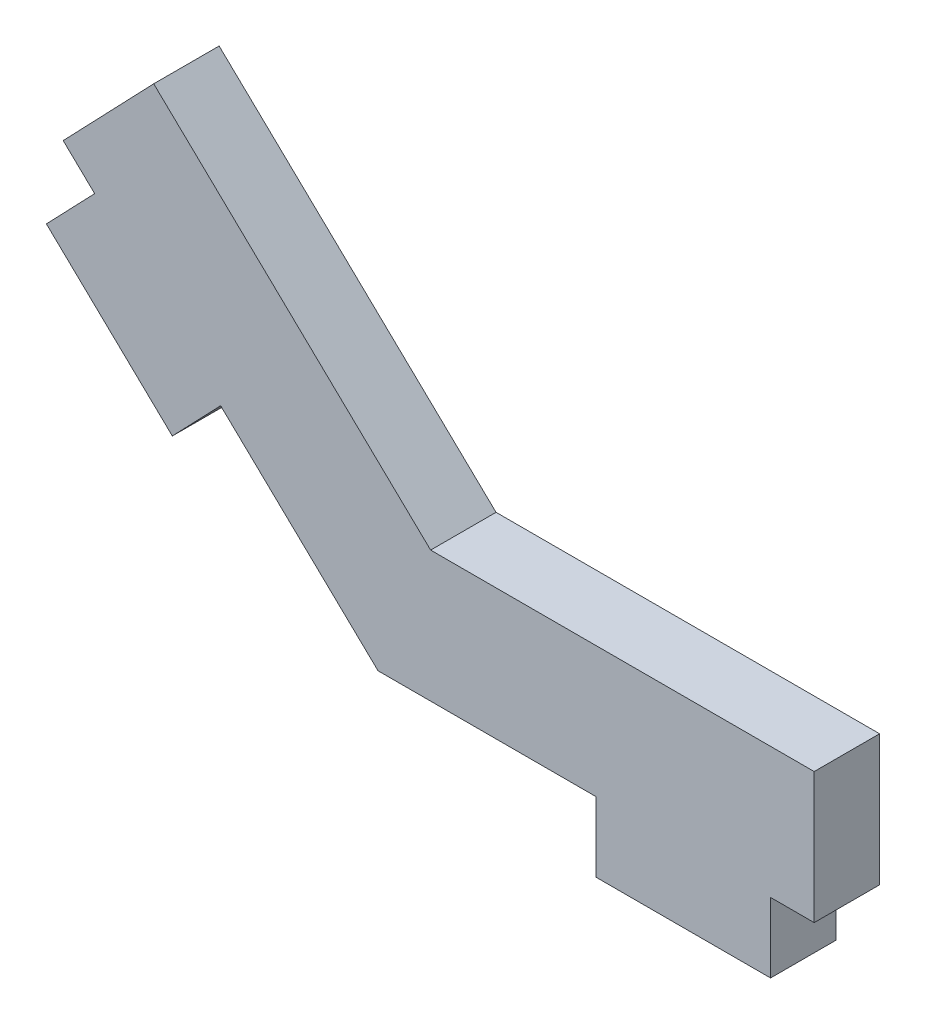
ISO-10303-21;
HEADER;
FILE_DESCRIPTION(('STEP AP214'),'2;1');
FILE_NAME('part.step','',(''),(''),'','','');
FILE_SCHEMA(('AUTOMOTIVE_DESIGN { 1 0 10303 214 1 1 1 1 }'));
ENDSEC;
DATA;
#1=APPLICATION_CONTEXT('core data for automotive mechanical design processes');
#2=APPLICATION_PROTOCOL_DEFINITION('international standard','automotive_design',2000,#1);
#3=PRODUCT_CONTEXT('',#1,'mechanical');
#4=PRODUCT('Part','Part','',(#3));
#5=PRODUCT_RELATED_PRODUCT_CATEGORY('part','',(#4));
#6=PRODUCT_DEFINITION_FORMATION('','',#4);
#7=PRODUCT_DEFINITION_CONTEXT('part definition',#1,'design');
#8=PRODUCT_DEFINITION('design','',#6,#7);
#9=PRODUCT_DEFINITION_SHAPE('','',#8);
#10=(LENGTH_UNIT() NAMED_UNIT(*) SI_UNIT(.MILLI.,.METRE.));
#11=(NAMED_UNIT(*) PLANE_ANGLE_UNIT() SI_UNIT($,.RADIAN.));
#12=(NAMED_UNIT(*) SI_UNIT($,.STERADIAN.) SOLID_ANGLE_UNIT());
#13=UNCERTAINTY_MEASURE_WITH_UNIT(LENGTH_MEASURE(1.E-05),#10,'distance_accuracy_value','');
#14=(GEOMETRIC_REPRESENTATION_CONTEXT(3) GLOBAL_UNCERTAINTY_ASSIGNED_CONTEXT((#13)) GLOBAL_UNIT_ASSIGNED_CONTEXT((#10,
#11,#12)) REPRESENTATION_CONTEXT('',''));
#15=CARTESIAN_POINT('',(0.,0.,0.));
#16=DIRECTION('',(0.,0.,1.));
#17=DIRECTION('',(1.,0.,0.));
#18=AXIS2_PLACEMENT_3D('',#15,#16,#17);
#19=CARTESIAN_POINT('',(0.,0.,3.));
#20=DIRECTION('',(0.,1.,0.));
#21=DIRECTION('',(0.,0.,1.));
#22=AXIS2_PLACEMENT_3D('',#19,#20,#21);
#23=PLANE('',#22);
#24=DIRECTION('',(0.,0.,-1.));
#25=VECTOR('',#24,1.);
#26=CARTESIAN_POINT('',(10.,0.,3.));
#27=LINE('',#26,#25);
#28=CARTESIAN_POINT('',(10.,0.,3.));
#29=VERTEX_POINT('',#28);
#30=CARTESIAN_POINT('',(10.,0.,0.));
#31=VERTEX_POINT('',#30);
#32=EDGE_CURVE('E140',#29,#31,#27,.T.);
#33=ORIENTED_EDGE('',*,*,#32,.F.);
#34=DIRECTION('',(1.,0.,0.));
#35=VECTOR('',#34,1.);
#36=CARTESIAN_POINT('',(0.,0.,3.));
#37=LINE('',#36,#35);
#38=CARTESIAN_POINT('',(0.,0.,3.));
#39=VERTEX_POINT('',#38);
#40=EDGE_CURVE('E157',#39,#29,#37,.T.);
#41=ORIENTED_EDGE('',*,*,#40,.F.);
#42=DIRECTION('',(0.,0.,-1.));
#43=VECTOR('',#42,1.);
#44=CARTESIAN_POINT('',(0.,0.,3.));
#45=LINE('',#44,#43);
#46=CARTESIAN_POINT('',(0.,0.,0.));
#47=VERTEX_POINT('',#46);
#48=EDGE_CURVE('E189',#39,#47,#45,.T.);
#49=ORIENTED_EDGE('',*,*,#48,.T.);
#50=DIRECTION('',(1.,0.,0.));
#51=VECTOR('',#50,1.);
#52=CARTESIAN_POINT('',(0.,0.,0.));
#53=LINE('',#52,#51);
#54=EDGE_CURVE('E184',#47,#31,#53,.T.);
#55=ORIENTED_EDGE('',*,*,#54,.T.);
#56=EDGE_LOOP('',(#33,#41,#49,#55));
#57=FACE_BOUND('',#56,.T.);
#58=ADVANCED_FACE('F35',(#57),#23,.F.);
#59=CARTESIAN_POINT('',(0.,0.,3.));
#60=DIRECTION('',(-0.691891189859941,-0.722001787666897,0.));
#61=DIRECTION('',(0.722001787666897,-0.691891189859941,0.));
#62=AXIS2_PLACEMENT_3D('',#59,#60,#61);
#63=PLANE('',#62);
#64=DIRECTION('',(-0.722001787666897,0.691891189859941,0.));
#65=VECTOR('',#64,1.);
#66=CARTESIAN_POINT('',(0.,0.,0.));
#67=LINE('',#66,#65);
#68=CARTESIAN_POINT('',(-12.9960321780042,12.4540414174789,0.));
#69=VERTEX_POINT('',#68);
#70=CARTESIAN_POINT('',(-14.4400357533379,13.8378237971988,0.));
#71=VERTEX_POINT('',#70);
#72=EDGE_CURVE('E179',#69,#71,#67,.T.);
#73=ORIENTED_EDGE('',*,*,#72,.F.);
#74=DIRECTION('',(0.,0.,-1.));
#75=VECTOR('',#74,1.);
#76=CARTESIAN_POINT('',(-12.9960321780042,12.4540414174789,3.));
#77=LINE('',#76,#75);
#78=CARTESIAN_POINT('',(-12.9960321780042,12.4540414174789,3.));
#79=VERTEX_POINT('',#78);
#80=EDGE_CURVE('E229',#79,#69,#77,.T.);
#81=ORIENTED_EDGE('',*,*,#80,.F.);
#82=DIRECTION('',(-0.722001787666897,0.691891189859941,0.));
#83=VECTOR('',#82,1.);
#84=CARTESIAN_POINT('',(0.,0.,3.));
#85=LINE('',#84,#83);
#86=CARTESIAN_POINT('',(-14.4400357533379,13.8378237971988,3.));
#87=VERTEX_POINT('',#86);
#88=EDGE_CURVE('E162',#79,#87,#85,.T.);
#89=ORIENTED_EDGE('',*,*,#88,.T.);
#90=DIRECTION('',(0.,0.,-1.));
#91=VECTOR('',#90,1.);
#92=CARTESIAN_POINT('',(-14.4400357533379,13.8378237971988,3.));
#93=LINE('',#92,#91);
#94=EDGE_CURVE('E191',#87,#71,#93,.T.);
#95=ORIENTED_EDGE('',*,*,#94,.T.);
#96=EDGE_LOOP('',(#73,#81,#89,#95));
#97=FACE_BOUND('',#96,.T.);
#98=ADVANCED_FACE('F270',(#97),#63,.T.);
#99=CARTESIAN_POINT('',(20.,0.,3.));
#100=DIRECTION('',(1.,0.,0.));
#101=DIRECTION('',(0.,0.,-1.));
#102=AXIS2_PLACEMENT_3D('',#99,#100,#101);
#103=PLANE('',#102);
#104=DIRECTION('',(0.,-1.,0.));
#105=VECTOR('',#104,1.);
#106=CARTESIAN_POINT('',(20.,0.,0.));
#107=LINE('',#106,#105);
#108=CARTESIAN_POINT('',(20.,6.,0.));
#109=VERTEX_POINT('',#108);
#110=CARTESIAN_POINT('',(20.,0.,0.));
#111=VERTEX_POINT('',#110);
#112=EDGE_CURVE('E166',#109,#111,#107,.T.);
#113=ORIENTED_EDGE('',*,*,#112,.F.);
#114=DIRECTION('',(0.,0.,-1.));
#115=VECTOR('',#114,1.);
#116=CARTESIAN_POINT('',(20.,6.,3.));
#117=LINE('',#116,#115);
#118=CARTESIAN_POINT('',(20.,6.,3.));
#119=VERTEX_POINT('',#118);
#120=EDGE_CURVE('E11',#119,#109,#117,.T.);
#121=ORIENTED_EDGE('',*,*,#120,.F.);
#122=DIRECTION('',(0.,-1.,0.));
#123=VECTOR('',#122,1.);
#124=CARTESIAN_POINT('',(20.,0.,3.));
#125=LINE('',#124,#123);
#126=CARTESIAN_POINT('',(20.,0.,3.));
#127=VERTEX_POINT('',#126);
#128=EDGE_CURVE('E187',#119,#127,#125,.T.);
#129=ORIENTED_EDGE('',*,*,#128,.T.);
#130=DIRECTION('',(0.,0.,-1.));
#131=VECTOR('',#130,1.);
#132=CARTESIAN_POINT('',(20.,0.,3.));
#133=LINE('',#132,#131);
#134=EDGE_CURVE('E155',#127,#111,#133,.T.);
#135=ORIENTED_EDGE('',*,*,#134,.T.);
#136=EDGE_LOOP('',(#113,#121,#129,#135));
#137=FACE_BOUND('',#136,.T.);
#138=ADVANCED_FACE('F37',(#137),#103,.T.);
#139=CARTESIAN_POINT('',(0.,6.,3.));
#140=DIRECTION('',(0.,1.,0.));
#141=DIRECTION('',(-1.,0.,0.));
#142=AXIS2_PLACEMENT_3D('',#139,#140,#141);
#143=PLANE('',#142);
#144=DIRECTION('',(1.,0.,0.));
#145=VECTOR('',#144,1.);
#146=CARTESIAN_POINT('',(0.,6.,0.));
#147=LINE('',#146,#145);
#148=CARTESIAN_POINT('',(2.41076819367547,5.99999999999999,0.));
#149=VERTEX_POINT('',#148);
#150=EDGE_CURVE('E169',#149,#109,#147,.T.);
#151=ORIENTED_EDGE('',*,*,#150,.F.);
#152=DIRECTION('',(0.,0.,-1.));
#153=VECTOR('',#152,1.);
#154=CARTESIAN_POINT('',(2.41076819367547,5.99999999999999,3.));
#155=LINE('',#154,#153);
#156=CARTESIAN_POINT('',(2.41076819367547,5.99999999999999,3.));
#157=VERTEX_POINT('',#156);
#158=EDGE_CURVE('E43',#157,#149,#155,.T.);
#159=ORIENTED_EDGE('',*,*,#158,.F.);
#160=DIRECTION('',(1.,0.,0.));
#161=VECTOR('',#160,1.);
#162=CARTESIAN_POINT('',(0.,6.,3.));
#163=LINE('',#162,#161);
#164=EDGE_CURVE('E217',#157,#119,#163,.T.);
#165=ORIENTED_EDGE('',*,*,#164,.T.);
#166=ORIENTED_EDGE('',*,*,#120,.T.);
#167=EDGE_LOOP('',(#151,#159,#165,#166));
#168=FACE_BOUND('',#167,.T.);
#169=ADVANCED_FACE('F205',(#168),#143,.T.);
#170=CARTESIAN_POINT('',(4.15134713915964,4.33201072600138,3.));
#171=DIRECTION('',(0.691891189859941,0.722001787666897,0.));
#172=DIRECTION('',(-0.722001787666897,0.691891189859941,0.));
#173=AXIS2_PLACEMENT_3D('',#170,#171,#172);
#174=PLANE('',#173);
#175=DIRECTION('',(0.722001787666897,-0.691891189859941,0.));
#176=VECTOR('',#175,1.);
#177=CARTESIAN_POINT('',(4.15134713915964,4.33201072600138,0.));
#178=LINE('',#177,#176);
#179=CARTESIAN_POINT('',(-10.2886886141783,18.1698345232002,0.));
#180=VERTEX_POINT('',#179);
#181=EDGE_CURVE('E173',#180,#149,#178,.T.);
#182=ORIENTED_EDGE('',*,*,#181,.F.);
#183=DIRECTION('',(0.,0.,-1.));
#184=VECTOR('',#183,1.);
#185=CARTESIAN_POINT('',(-10.2886886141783,18.1698345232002,3.));
#186=LINE('',#185,#184);
#187=CARTESIAN_POINT('',(-10.2886886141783,18.1698345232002,3.));
#188=VERTEX_POINT('',#187);
#189=EDGE_CURVE('E194',#188,#180,#186,.T.);
#190=ORIENTED_EDGE('',*,*,#189,.F.);
#191=DIRECTION('',(0.722001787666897,-0.691891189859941,0.));
#192=VECTOR('',#191,1.);
#193=CARTESIAN_POINT('',(4.15134713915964,4.33201072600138,3.));
#194=LINE('',#193,#192);
#195=EDGE_CURVE('E201',#188,#157,#194,.T.);
#196=ORIENTED_EDGE('',*,*,#195,.T.);
#197=ORIENTED_EDGE('',*,*,#158,.T.);
#198=EDGE_LOOP('',(#182,#190,#196,#197));
#199=FACE_BOUND('',#198,.T.);
#200=ADVANCED_FACE('F199',(#199),#174,.T.);
#201=CARTESIAN_POINT('',(-14.440035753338,13.8378237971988,3.));
#202=DIRECTION('',(-0.722001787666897,0.691891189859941,0.));
#203=DIRECTION('',(-0.691891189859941,-0.722001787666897,0.));
#204=AXIS2_PLACEMENT_3D('',#201,#202,#203);
#205=PLANE('',#204);
#206=DIRECTION('',(0.691891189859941,0.722001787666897,0.));
#207=VECTOR('',#206,1.);
#208=CARTESIAN_POINT('',(-14.440035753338,13.8378237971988,0.));
#209=LINE('',#208,#207);
#210=EDGE_CURVE('E176',#71,#180,#209,.T.);
#211=ORIENTED_EDGE('',*,*,#210,.F.);
#212=ORIENTED_EDGE('',*,*,#94,.F.);
#213=DIRECTION('',(0.691891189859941,0.722001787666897,0.));
#214=VECTOR('',#213,1.);
#215=CARTESIAN_POINT('',(-14.440035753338,13.8378237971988,3.));
#216=LINE('',#215,#214);
#217=EDGE_CURVE('E215',#87,#188,#216,.T.);
#218=ORIENTED_EDGE('',*,*,#217,.T.);
#219=ORIENTED_EDGE('',*,*,#189,.T.);
#220=EDGE_LOOP('',(#211,#212,#218,#219));
#221=FACE_BOUND('',#220,.T.);
#222=ADVANCED_FACE('F212',(#221),#205,.T.);
#223=DIRECTION('',(0.,0.,-1.));
#224=VECTOR('',#223,1.);
#225=CARTESIAN_POINT('',(-7.22001787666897,6.91891189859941,3.));
#226=LINE('',#225,#224);
#227=CARTESIAN_POINT('',(-7.22001787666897,6.91891189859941,3.));
#228=VERTEX_POINT('',#227);
#229=CARTESIAN_POINT('',(-7.22001787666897,6.91891189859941,0.));
#230=VERTEX_POINT('',#229);
#231=EDGE_CURVE('E226',#228,#230,#226,.T.);
#232=ORIENTED_EDGE('',*,*,#231,.T.);
#233=EDGE_CURVE('E180',#47,#230,#67,.T.);
#234=ORIENTED_EDGE('',*,*,#233,.F.);
#235=ORIENTED_EDGE('',*,*,#48,.F.);
#236=EDGE_CURVE('E158',#39,#228,#85,.T.);
#237=ORIENTED_EDGE('',*,*,#236,.T.);
#238=EDGE_LOOP('',(#232,#234,#235,#237));
#239=FACE_BOUND('',#238,.T.);
#240=ADVANCED_FACE('F277',(#239),#63,.T.);
#241=CARTESIAN_POINT('',(18.,0.,3.));
#242=VERTEX_POINT('',#241);
#243=EDGE_CURVE('E145',#242,#127,#37,.T.);
#244=ORIENTED_EDGE('',*,*,#243,.F.);
#245=DIRECTION('',(0.,0.,-1.));
#246=VECTOR('',#245,1.);
#247=CARTESIAN_POINT('',(18.,0.,3.));
#248=LINE('',#247,#246);
#249=CARTESIAN_POINT('',(18.,0.,0.));
#250=VERTEX_POINT('',#249);
#251=EDGE_CURVE('E133',#242,#250,#248,.T.);
#252=ORIENTED_EDGE('',*,*,#251,.T.);
#253=EDGE_CURVE('E183',#250,#111,#53,.T.);
#254=ORIENTED_EDGE('',*,*,#253,.T.);
#255=ORIENTED_EDGE('',*,*,#134,.F.);
#256=EDGE_LOOP('',(#244,#252,#254,#255));
#257=FACE_BOUND('',#256,.T.);
#258=ADVANCED_FACE('F153',(#257),#23,.F.);
#259=CARTESIAN_POINT('',(0.,0.,3.));
#260=DIRECTION('',(0.,0.,1.));
#261=DIRECTION('',(1.,0.,0.));
#262=AXIS2_PLACEMENT_3D('',#259,#260,#261);
#263=PLANE('',#262);
#264=ORIENTED_EDGE('',*,*,#128,.F.);
#265=ORIENTED_EDGE('',*,*,#164,.F.);
#266=ORIENTED_EDGE('',*,*,#195,.F.);
#267=ORIENTED_EDGE('',*,*,#217,.F.);
#268=ORIENTED_EDGE('',*,*,#88,.F.);
#269=DIRECTION('',(-0.691891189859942,-0.722001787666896,0.));
#270=VECTOR('',#269,1.);
#271=CARTESIAN_POINT('',(-12.9960321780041,12.4540414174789,3.));
#272=LINE('',#271,#270);
#273=CARTESIAN_POINT('',(-15.210083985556,10.1436356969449,3.));
#274=VERTEX_POINT('',#273);
#275=EDGE_CURVE('E235',#79,#274,#272,.T.);
#276=ORIENTED_EDGE('',*,*,#275,.T.);
#277=DIRECTION('',(0.722001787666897,-0.691891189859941,0.));
#278=VECTOR('',#277,1.);
#279=CARTESIAN_POINT('',(-2.21405180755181,-2.31040572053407,3.));
#280=LINE('',#279,#278);
#281=CARTESIAN_POINT('',(-9.43406968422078,4.60850617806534,3.));
#282=VERTEX_POINT('',#281);
#283=EDGE_CURVE('E242',#274,#282,#280,.T.);
#284=ORIENTED_EDGE('',*,*,#283,.T.);
#285=DIRECTION('',(-0.691891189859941,-0.722001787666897,0.));
#286=VECTOR('',#285,1.);
#287=CARTESIAN_POINT('',(-7.22001787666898,6.91891189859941,3.));
#288=LINE('',#287,#286);
#289=EDGE_CURVE('E231',#228,#282,#288,.T.);
#290=ORIENTED_EDGE('',*,*,#289,.F.);
#291=ORIENTED_EDGE('',*,*,#236,.F.);
#292=ORIENTED_EDGE('',*,*,#40,.T.);
#293=DIRECTION('',(0.,-1.,0.));
#294=VECTOR('',#293,1.);
#295=CARTESIAN_POINT('',(10.,0.,3.));
#296=LINE('',#295,#294);
#297=CARTESIAN_POINT('',(10.,-3.2,3.));
#298=VERTEX_POINT('',#297);
#299=EDGE_CURVE('E150',#29,#298,#296,.T.);
#300=ORIENTED_EDGE('',*,*,#299,.T.);
#301=DIRECTION('',(1.,0.,0.));
#302=VECTOR('',#301,1.);
#303=CARTESIAN_POINT('',(0.,-3.2,3.));
#304=LINE('',#303,#302);
#305=CARTESIAN_POINT('',(18.,-3.2,3.));
#306=VERTEX_POINT('',#305);
#307=EDGE_CURVE('E148',#298,#306,#304,.T.);
#308=ORIENTED_EDGE('',*,*,#307,.T.);
#309=DIRECTION('',(0.,-1.,0.));
#310=VECTOR('',#309,1.);
#311=CARTESIAN_POINT('',(18.,0.,3.));
#312=LINE('',#311,#310);
#313=EDGE_CURVE('E136',#242,#306,#312,.T.);
#314=ORIENTED_EDGE('',*,*,#313,.F.);
#315=ORIENTED_EDGE('',*,*,#243,.T.);
#316=EDGE_LOOP('',(#264,#265,#266,#267,#268,#276,#284,#290,#291,#292,#300,#308,#314,#315));
#317=FACE_BOUND('',#316,.T.);
#318=ADVANCED_FACE('F144',(#317),#263,.T.);
#319=CARTESIAN_POINT('',(0.,0.,0.));
#320=DIRECTION('',(0.,0.,1.));
#321=DIRECTION('',(1.,0.,0.));
#322=AXIS2_PLACEMENT_3D('',#319,#320,#321);
#323=PLANE('',#322);
#324=ORIENTED_EDGE('',*,*,#112,.T.);
#325=ORIENTED_EDGE('',*,*,#253,.F.);
#326=DIRECTION('',(0.,-1.,0.));
#327=VECTOR('',#326,1.);
#328=CARTESIAN_POINT('',(18.,0.,0.));
#329=LINE('',#328,#327);
#330=CARTESIAN_POINT('',(18.,-3.2,0.));
#331=VERTEX_POINT('',#330);
#332=EDGE_CURVE('E50',#250,#331,#329,.T.);
#333=ORIENTED_EDGE('',*,*,#332,.T.);
#334=DIRECTION('',(1.,0.,0.));
#335=VECTOR('',#334,1.);
#336=CARTESIAN_POINT('',(0.,-3.2,0.));
#337=LINE('',#336,#335);
#338=CARTESIAN_POINT('',(10.,-3.2,0.));
#339=VERTEX_POINT('',#338);
#340=EDGE_CURVE('E151',#339,#331,#337,.T.);
#341=ORIENTED_EDGE('',*,*,#340,.F.);
#342=DIRECTION('',(0.,-1.,0.));
#343=VECTOR('',#342,1.);
#344=CARTESIAN_POINT('',(10.,0.,0.));
#345=LINE('',#344,#343);
#346=EDGE_CURVE('E254',#31,#339,#345,.T.);
#347=ORIENTED_EDGE('',*,*,#346,.F.);
#348=ORIENTED_EDGE('',*,*,#54,.F.);
#349=ORIENTED_EDGE('',*,*,#233,.T.);
#350=DIRECTION('',(-0.691891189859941,-0.722001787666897,0.));
#351=VECTOR('',#350,1.);
#352=CARTESIAN_POINT('',(-7.22001787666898,6.91891189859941,0.));
#353=LINE('',#352,#351);
#354=CARTESIAN_POINT('',(-9.43406968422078,4.60850617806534,0.));
#355=VERTEX_POINT('',#354);
#356=EDGE_CURVE('E232',#230,#355,#353,.T.);
#357=ORIENTED_EDGE('',*,*,#356,.T.);
#358=DIRECTION('',(0.722001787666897,-0.691891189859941,0.));
#359=VECTOR('',#358,1.);
#360=CARTESIAN_POINT('',(-2.21405180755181,-2.31040572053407,0.));
#361=LINE('',#360,#359);
#362=CARTESIAN_POINT('',(-15.210083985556,10.1436356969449,0.));
#363=VERTEX_POINT('',#362);
#364=EDGE_CURVE('E236',#363,#355,#361,.T.);
#365=ORIENTED_EDGE('',*,*,#364,.F.);
#366=DIRECTION('',(-0.691891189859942,-0.722001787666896,0.));
#367=VECTOR('',#366,1.);
#368=CARTESIAN_POINT('',(-12.9960321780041,12.4540414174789,0.));
#369=LINE('',#368,#367);
#370=EDGE_CURVE('E58',#69,#363,#369,.T.);
#371=ORIENTED_EDGE('',*,*,#370,.F.);
#372=ORIENTED_EDGE('',*,*,#72,.T.);
#373=ORIENTED_EDGE('',*,*,#210,.T.);
#374=ORIENTED_EDGE('',*,*,#181,.T.);
#375=ORIENTED_EDGE('',*,*,#150,.T.);
#376=EDGE_LOOP('',(#324,#325,#333,#341,#347,#348,#349,#357,#365,#371,#372,#373,#374,#375));
#377=FACE_BOUND('',#376,.T.);
#378=ADVANCED_FACE('F207',(#377),#323,.F.);
#379=CARTESIAN_POINT('',(-12.9960321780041,12.4540414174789,3.));
#380=DIRECTION('',(0.722001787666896,-0.691891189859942,0.));
#381=DIRECTION('',(0.691891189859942,0.722001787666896,0.));
#382=AXIS2_PLACEMENT_3D('',#379,#380,#381);
#383=PLANE('',#382);
#384=ORIENTED_EDGE('',*,*,#370,.T.);
#385=DIRECTION('',(0.,0.,-1.));
#386=VECTOR('',#385,1.);
#387=CARTESIAN_POINT('',(-15.210083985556,10.1436356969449,3.));
#388=LINE('',#387,#386);
#389=EDGE_CURVE('E170',#274,#363,#388,.T.);
#390=ORIENTED_EDGE('',*,*,#389,.F.);
#391=ORIENTED_EDGE('',*,*,#275,.F.);
#392=ORIENTED_EDGE('',*,*,#80,.T.);
#393=EDGE_LOOP('',(#384,#390,#391,#392));
#394=FACE_BOUND('',#393,.T.);
#395=ADVANCED_FACE('F345',(#394),#383,.F.);
#396=CARTESIAN_POINT('',(-2.21405180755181,-2.31040572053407,3.));
#397=DIRECTION('',(0.691891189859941,0.722001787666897,0.));
#398=DIRECTION('',(-0.722001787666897,0.691891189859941,0.));
#399=AXIS2_PLACEMENT_3D('',#396,#397,#398);
#400=PLANE('',#399);
#401=ORIENTED_EDGE('',*,*,#364,.T.);
#402=DIRECTION('',(0.,0.,-1.));
#403=VECTOR('',#402,1.);
#404=CARTESIAN_POINT('',(-9.43406968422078,4.60850617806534,3.));
#405=LINE('',#404,#403);
#406=EDGE_CURVE('E224',#282,#355,#405,.T.);
#407=ORIENTED_EDGE('',*,*,#406,.F.);
#408=ORIENTED_EDGE('',*,*,#283,.F.);
#409=ORIENTED_EDGE('',*,*,#389,.T.);
#410=EDGE_LOOP('',(#401,#407,#408,#409));
#411=FACE_BOUND('',#410,.T.);
#412=ADVANCED_FACE('F353',(#411),#400,.F.);
#413=CARTESIAN_POINT('',(-7.22001787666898,6.91891189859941,3.));
#414=DIRECTION('',(0.722001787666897,-0.691891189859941,0.));
#415=DIRECTION('',(0.691891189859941,0.722001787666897,0.));
#416=AXIS2_PLACEMENT_3D('',#413,#414,#415);
#417=PLANE('',#416);
#418=ORIENTED_EDGE('',*,*,#356,.F.);
#419=ORIENTED_EDGE('',*,*,#231,.F.);
#420=ORIENTED_EDGE('',*,*,#289,.T.);
#421=ORIENTED_EDGE('',*,*,#406,.T.);
#422=EDGE_LOOP('',(#418,#419,#420,#421));
#423=FACE_BOUND('',#422,.T.);
#424=ADVANCED_FACE('F363',(#423),#417,.T.);
#425=CARTESIAN_POINT('',(18.,0.,3.));
#426=DIRECTION('',(1.,0.,0.));
#427=DIRECTION('',(0.,0.,-1.));
#428=AXIS2_PLACEMENT_3D('',#425,#426,#427);
#429=PLANE('',#428);
#430=ORIENTED_EDGE('',*,*,#332,.F.);
#431=ORIENTED_EDGE('',*,*,#251,.F.);
#432=ORIENTED_EDGE('',*,*,#313,.T.);
#433=DIRECTION('',(0.,0.,-1.));
#434=VECTOR('',#433,1.);
#435=CARTESIAN_POINT('',(18.,-3.2,3.));
#436=LINE('',#435,#434);
#437=EDGE_CURVE('E250',#306,#331,#436,.T.);
#438=ORIENTED_EDGE('',*,*,#437,.T.);
#439=EDGE_LOOP('',(#430,#431,#432,#438));
#440=FACE_BOUND('',#439,.T.);
#441=ADVANCED_FACE('F135',(#440),#429,.T.);
#442=CARTESIAN_POINT('',(10.,0.,3.));
#443=DIRECTION('',(1.,0.,0.));
#444=DIRECTION('',(0.,0.,-1.));
#445=AXIS2_PLACEMENT_3D('',#442,#443,#444);
#446=PLANE('',#445);
#447=ORIENTED_EDGE('',*,*,#346,.T.);
#448=DIRECTION('',(0.,0.,-1.));
#449=VECTOR('',#448,1.);
#450=CARTESIAN_POINT('',(10.,-3.2,3.));
#451=LINE('',#450,#449);
#452=EDGE_CURVE('E247',#298,#339,#451,.T.);
#453=ORIENTED_EDGE('',*,*,#452,.F.);
#454=ORIENTED_EDGE('',*,*,#299,.F.);
#455=ORIENTED_EDGE('',*,*,#32,.T.);
#456=EDGE_LOOP('',(#447,#453,#454,#455));
#457=FACE_BOUND('',#456,.T.);
#458=ADVANCED_FACE('F263',(#457),#446,.F.);
#459=CARTESIAN_POINT('',(0.,-3.2,3.));
#460=DIRECTION('',(0.,1.,0.));
#461=DIRECTION('',(0.,0.,1.));
#462=AXIS2_PLACEMENT_3D('',#459,#460,#461);
#463=PLANE('',#462);
#464=ORIENTED_EDGE('',*,*,#340,.T.);
#465=ORIENTED_EDGE('',*,*,#437,.F.);
#466=ORIENTED_EDGE('',*,*,#307,.F.);
#467=ORIENTED_EDGE('',*,*,#452,.T.);
#468=EDGE_LOOP('',(#464,#465,#466,#467));
#469=FACE_BOUND('',#468,.T.);
#470=ADVANCED_FACE('F267',(#469),#463,.F.);
#471=CLOSED_SHELL('',(#58,#98,#138,#169,#200,#222,#240,#258,#318,#378,#395,#412,#424,#441,#458,#470));
#472=MANIFOLD_SOLID_BREP('B2',#471);
#473=ADVANCED_BREP_SHAPE_REPRESENTATION('',(#18,#472),#14);
#474=SHAPE_DEFINITION_REPRESENTATION(#9,#473);
ENDSEC;
END-ISO-10303-21;
